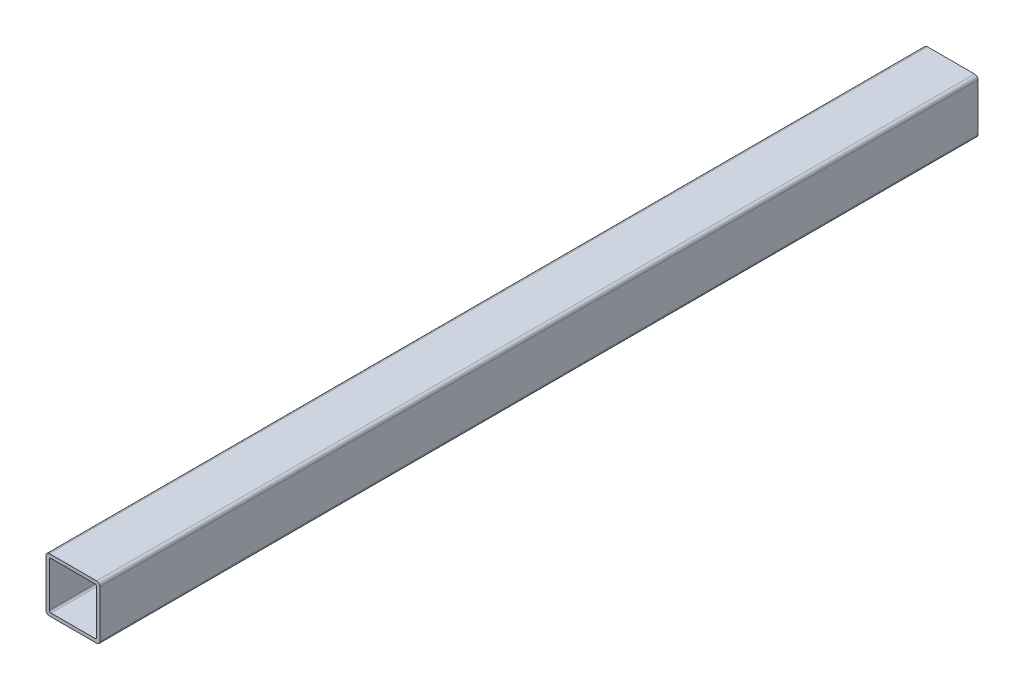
ISO-10303-21;
HEADER;
FILE_DESCRIPTION(('STEP AP214'),'2;1');
FILE_NAME('part.step','',(''),(''),'','','');
FILE_SCHEMA(('AUTOMOTIVE_DESIGN { 1 0 10303 214 1 1 1 1 }'));
ENDSEC;
DATA;
#1=APPLICATION_CONTEXT('core data for automotive mechanical design processes');
#2=APPLICATION_PROTOCOL_DEFINITION('international standard','automotive_design',2000,#1);
#3=PRODUCT_CONTEXT('',#1,'mechanical');
#4=PRODUCT('Part','Part','',(#3));
#5=PRODUCT_RELATED_PRODUCT_CATEGORY('part','',(#4));
#6=PRODUCT_DEFINITION_FORMATION('','',#4);
#7=PRODUCT_DEFINITION_CONTEXT('part definition',#1,'design');
#8=PRODUCT_DEFINITION('design','',#6,#7);
#9=PRODUCT_DEFINITION_SHAPE('','',#8);
#10=(LENGTH_UNIT() NAMED_UNIT(*) SI_UNIT(.MILLI.,.METRE.));
#11=(NAMED_UNIT(*) PLANE_ANGLE_UNIT() SI_UNIT($,.RADIAN.));
#12=(NAMED_UNIT(*) SI_UNIT($,.STERADIAN.) SOLID_ANGLE_UNIT());
#13=UNCERTAINTY_MEASURE_WITH_UNIT(LENGTH_MEASURE(1.E-05),#10,'distance_accuracy_value','');
#14=(GEOMETRIC_REPRESENTATION_CONTEXT(3) GLOBAL_UNCERTAINTY_ASSIGNED_CONTEXT((#13)) GLOBAL_UNIT_ASSIGNED_CONTEXT((#10,
#11,#12)) REPRESENTATION_CONTEXT('',''));
#15=CARTESIAN_POINT('',(0.,0.,0.));
#16=DIRECTION('',(0.,0.,1.));
#17=DIRECTION('',(1.,0.,0.));
#18=AXIS2_PLACEMENT_3D('',#15,#16,#17);
#19=CARTESIAN_POINT('',(-22.225,-22.225,412.75));
#20=DIRECTION('',(0.,0.,1.));
#21=DIRECTION('',(1.,0.,0.));
#22=AXIS2_PLACEMENT_3D('',#19,#20,#21);
#23=PLANE('',#22);
#24=CARTESIAN_POINT('',(-22.225,-22.225,412.75));
#25=DIRECTION('',(0.,0.,1.));
#26=DIRECTION('',(1.,0.,0.));
#27=AXIS2_PLACEMENT_3D('',#24,#25,#26);
#28=CIRCLE('',#27,3.175);
#29=CARTESIAN_POINT('',(-25.4,-22.225,412.75));
#30=VERTEX_POINT('',#29);
#31=CARTESIAN_POINT('',(-22.225,-25.4,412.75));
#32=VERTEX_POINT('',#31);
#33=EDGE_CURVE('E211',#30,#32,#28,.T.);
#34=ORIENTED_EDGE('',*,*,#33,.T.);
#35=DIRECTION('',(1.,0.,0.));
#36=VECTOR('',#35,1.);
#37=CARTESIAN_POINT('',(-22.225,-25.4,412.75));
#38=LINE('',#37,#36);
#39=CARTESIAN_POINT('',(22.225,-25.4,412.75));
#40=VERTEX_POINT('',#39);
#41=EDGE_CURVE('E214',#32,#40,#38,.T.);
#42=ORIENTED_EDGE('',*,*,#41,.T.);
#43=CARTESIAN_POINT('',(22.225,-22.225,412.75));
#44=DIRECTION('',(0.,0.,1.));
#45=DIRECTION('',(1.,0.,0.));
#46=AXIS2_PLACEMENT_3D('',#43,#44,#45);
#47=CIRCLE('',#46,3.175);
#48=CARTESIAN_POINT('',(25.4,-22.225,412.75));
#49=VERTEX_POINT('',#48);
#50=EDGE_CURVE('E217',#40,#49,#47,.T.);
#51=ORIENTED_EDGE('',*,*,#50,.T.);
#52=DIRECTION('',(0.,1.,0.));
#53=VECTOR('',#52,1.);
#54=CARTESIAN_POINT('',(25.4,22.225,412.75));
#55=LINE('',#54,#53);
#56=CARTESIAN_POINT('',(25.4,22.225,412.75));
#57=VERTEX_POINT('',#56);
#58=EDGE_CURVE('E219',#49,#57,#55,.T.);
#59=ORIENTED_EDGE('',*,*,#58,.T.);
#60=CARTESIAN_POINT('',(22.225,22.225,412.75));
#61=DIRECTION('',(0.,0.,1.));
#62=DIRECTION('',(-1.,0.,0.));
#63=AXIS2_PLACEMENT_3D('',#60,#61,#62);
#64=CIRCLE('',#63,3.175);
#65=CARTESIAN_POINT('',(22.225,25.4,412.75));
#66=VERTEX_POINT('',#65);
#67=EDGE_CURVE('E221',#57,#66,#64,.T.);
#68=ORIENTED_EDGE('',*,*,#67,.T.);
#69=DIRECTION('',(-1.,0.,0.));
#70=VECTOR('',#69,1.);
#71=CARTESIAN_POINT('',(-22.225,25.4,412.75));
#72=LINE('',#71,#70);
#73=CARTESIAN_POINT('',(-22.225,25.4,412.75));
#74=VERTEX_POINT('',#73);
#75=EDGE_CURVE('E223',#66,#74,#72,.T.);
#76=ORIENTED_EDGE('',*,*,#75,.T.);
#77=CARTESIAN_POINT('',(-22.225,22.225,412.75));
#78=DIRECTION('',(0.,0.,1.));
#79=DIRECTION('',(1.,0.,0.));
#80=AXIS2_PLACEMENT_3D('',#77,#78,#79);
#81=CIRCLE('',#80,3.175);
#82=CARTESIAN_POINT('',(-25.4,22.225,412.75));
#83=VERTEX_POINT('',#82);
#84=EDGE_CURVE('E225',#74,#83,#81,.T.);
#85=ORIENTED_EDGE('',*,*,#84,.T.);
#86=DIRECTION('',(0.,-1.,0.));
#87=VECTOR('',#86,1.);
#88=CARTESIAN_POINT('',(-25.4,22.225,412.75));
#89=LINE('',#88,#87);
#90=EDGE_CURVE('E227',#83,#30,#89,.T.);
#91=ORIENTED_EDGE('',*,*,#90,.T.);
#92=EDGE_LOOP('',(#34,#42,#51,#59,#68,#76,#85,#91));
#93=FACE_BOUND('',#92,.T.);
#94=DIRECTION('',(0.,-1.,0.));
#95=VECTOR('',#94,1.);
#96=CARTESIAN_POINT('',(-22.225,20.6375,412.75));
#97=LINE('',#96,#95);
#98=CARTESIAN_POINT('',(-22.225,20.6375,412.75));
#99=VERTEX_POINT('',#98);
#100=CARTESIAN_POINT('',(-22.225,-20.6375,412.75));
#101=VERTEX_POINT('',#100);
#102=EDGE_CURVE('E154',#99,#101,#97,.T.);
#103=ORIENTED_EDGE('',*,*,#102,.F.);
#104=CARTESIAN_POINT('',(-20.6375,20.6375,412.75));
#105=DIRECTION('',(0.,0.,1.));
#106=DIRECTION('',(1.,0.,0.));
#107=AXIS2_PLACEMENT_3D('',#104,#105,#106);
#108=CIRCLE('',#107,1.5875);
#109=CARTESIAN_POINT('',(-20.6375,22.225,412.75));
#110=VERTEX_POINT('',#109);
#111=EDGE_CURVE('E146',#110,#99,#108,.T.);
#112=ORIENTED_EDGE('',*,*,#111,.F.);
#113=DIRECTION('',(-1.,0.,0.));
#114=VECTOR('',#113,1.);
#115=CARTESIAN_POINT('',(-20.6375,22.225,412.75));
#116=LINE('',#115,#114);
#117=CARTESIAN_POINT('',(20.6375,22.225,412.75));
#118=VERTEX_POINT('',#117);
#119=EDGE_CURVE('E179',#118,#110,#116,.T.);
#120=ORIENTED_EDGE('',*,*,#119,.F.);
#121=CARTESIAN_POINT('',(20.6375,20.6375,412.75));
#122=DIRECTION('',(0.,0.,1.));
#123=DIRECTION('',(-1.,0.,0.));
#124=AXIS2_PLACEMENT_3D('',#121,#122,#123);
#125=CIRCLE('',#124,1.5875);
#126=CARTESIAN_POINT('',(22.225,20.6375,412.75));
#127=VERTEX_POINT('',#126);
#128=EDGE_CURVE('E177',#127,#118,#125,.T.);
#129=ORIENTED_EDGE('',*,*,#128,.F.);
#130=DIRECTION('',(0.,1.,0.));
#131=VECTOR('',#130,1.);
#132=CARTESIAN_POINT('',(22.225,20.6375,412.75));
#133=LINE('',#132,#131);
#134=CARTESIAN_POINT('',(22.225,-20.6375,412.75));
#135=VERTEX_POINT('',#134);
#136=EDGE_CURVE('E175',#135,#127,#133,.T.);
#137=ORIENTED_EDGE('',*,*,#136,.F.);
#138=CARTESIAN_POINT('',(20.6375,-20.6375,412.75));
#139=DIRECTION('',(0.,0.,1.));
#140=DIRECTION('',(1.,0.,0.));
#141=AXIS2_PLACEMENT_3D('',#138,#139,#140);
#142=CIRCLE('',#141,1.5875);
#143=CARTESIAN_POINT('',(20.6375,-22.225,412.75));
#144=VERTEX_POINT('',#143);
#145=EDGE_CURVE('E173',#144,#135,#142,.T.);
#146=ORIENTED_EDGE('',*,*,#145,.F.);
#147=DIRECTION('',(1.,0.,0.));
#148=VECTOR('',#147,1.);
#149=CARTESIAN_POINT('',(-20.6375,-22.225,412.75));
#150=LINE('',#149,#148);
#151=CARTESIAN_POINT('',(-20.6375,-22.225,412.75));
#152=VERTEX_POINT('',#151);
#153=EDGE_CURVE('E169',#152,#144,#150,.T.);
#154=ORIENTED_EDGE('',*,*,#153,.F.);
#155=CARTESIAN_POINT('',(-20.6375,-20.6375,412.75));
#156=DIRECTION('',(0.,0.,1.));
#157=DIRECTION('',(1.,0.,0.));
#158=AXIS2_PLACEMENT_3D('',#155,#156,#157);
#159=CIRCLE('',#158,1.5875);
#160=EDGE_CURVE('E167',#101,#152,#159,.T.);
#161=ORIENTED_EDGE('',*,*,#160,.F.);
#162=EDGE_LOOP('',(#103,#112,#120,#129,#137,#146,#154,#161));
#163=FACE_BOUND('',#162,.T.);
#164=ADVANCED_FACE('F33',(#93,#163),#23,.T.);
#165=CARTESIAN_POINT('',(-22.225,-22.225,-412.75));
#166=DIRECTION('',(0.,0.,1.));
#167=DIRECTION('',(1.,0.,0.));
#168=AXIS2_PLACEMENT_3D('',#165,#166,#167);
#169=PLANE('',#168);
#170=CARTESIAN_POINT('',(-22.225,-22.225,-412.75));
#171=DIRECTION('',(0.,0.,1.));
#172=DIRECTION('',(1.,0.,0.));
#173=AXIS2_PLACEMENT_3D('',#170,#171,#172);
#174=CIRCLE('',#173,3.175);
#175=CARTESIAN_POINT('',(-25.4,-22.225,-412.75));
#176=VERTEX_POINT('',#175);
#177=CARTESIAN_POINT('',(-22.225,-25.4,-412.75));
#178=VERTEX_POINT('',#177);
#179=EDGE_CURVE('E162',#176,#178,#174,.T.);
#180=ORIENTED_EDGE('',*,*,#179,.F.);
#181=DIRECTION('',(0.,-1.,0.));
#182=VECTOR('',#181,1.);
#183=CARTESIAN_POINT('',(-25.4,22.225,-412.75));
#184=LINE('',#183,#182);
#185=CARTESIAN_POINT('',(-25.4,22.225,-412.75));
#186=VERTEX_POINT('',#185);
#187=EDGE_CURVE('E215',#186,#176,#184,.T.);
#188=ORIENTED_EDGE('',*,*,#187,.F.);
#189=CARTESIAN_POINT('',(-22.225,22.225,-412.75));
#190=DIRECTION('',(0.,0.,1.));
#191=DIRECTION('',(1.,0.,0.));
#192=AXIS2_PLACEMENT_3D('',#189,#190,#191);
#193=CIRCLE('',#192,3.175);
#194=CARTESIAN_POINT('',(-22.225,25.4,-412.75));
#195=VERTEX_POINT('',#194);
#196=EDGE_CURVE('E242',#195,#186,#193,.T.);
#197=ORIENTED_EDGE('',*,*,#196,.F.);
#198=DIRECTION('',(-1.,0.,0.));
#199=VECTOR('',#198,1.);
#200=CARTESIAN_POINT('',(-22.225,25.4,-412.75));
#201=LINE('',#200,#199);
#202=CARTESIAN_POINT('',(22.225,25.4,-412.75));
#203=VERTEX_POINT('',#202);
#204=EDGE_CURVE('E240',#203,#195,#201,.T.);
#205=ORIENTED_EDGE('',*,*,#204,.F.);
#206=CARTESIAN_POINT('',(22.225,22.225,-412.75));
#207=DIRECTION('',(0.,0.,1.));
#208=DIRECTION('',(-1.,0.,0.));
#209=AXIS2_PLACEMENT_3D('',#206,#207,#208);
#210=CIRCLE('',#209,3.175);
#211=CARTESIAN_POINT('',(25.4,22.225,-412.75));
#212=VERTEX_POINT('',#211);
#213=EDGE_CURVE('E238',#212,#203,#210,.T.);
#214=ORIENTED_EDGE('',*,*,#213,.F.);
#215=DIRECTION('',(0.,1.,0.));
#216=VECTOR('',#215,1.);
#217=CARTESIAN_POINT('',(25.4,22.225,-412.75));
#218=LINE('',#217,#216);
#219=CARTESIAN_POINT('',(25.4,-22.225,-412.75));
#220=VERTEX_POINT('',#219);
#221=EDGE_CURVE('E236',#220,#212,#218,.T.);
#222=ORIENTED_EDGE('',*,*,#221,.F.);
#223=CARTESIAN_POINT('',(22.225,-22.225,-412.75));
#224=DIRECTION('',(0.,0.,1.));
#225=DIRECTION('',(1.,0.,0.));
#226=AXIS2_PLACEMENT_3D('',#223,#224,#225);
#227=CIRCLE('',#226,3.175);
#228=CARTESIAN_POINT('',(22.225,-25.4,-412.75));
#229=VERTEX_POINT('',#228);
#230=EDGE_CURVE('E234',#229,#220,#227,.T.);
#231=ORIENTED_EDGE('',*,*,#230,.F.);
#232=DIRECTION('',(1.,0.,0.));
#233=VECTOR('',#232,1.);
#234=CARTESIAN_POINT('',(-22.225,-25.4,-412.75));
#235=LINE('',#234,#233);
#236=EDGE_CURVE('E232',#178,#229,#235,.T.);
#237=ORIENTED_EDGE('',*,*,#236,.F.);
#238=EDGE_LOOP('',(#180,#188,#197,#205,#214,#222,#231,#237));
#239=FACE_BOUND('',#238,.T.);
#240=CARTESIAN_POINT('',(-20.6375,20.6375,-412.75));
#241=DIRECTION('',(0.,0.,1.));
#242=DIRECTION('',(1.,0.,0.));
#243=AXIS2_PLACEMENT_3D('',#240,#241,#242);
#244=CIRCLE('',#243,1.5875);
#245=CARTESIAN_POINT('',(-20.6375,22.225,-412.75));
#246=VERTEX_POINT('',#245);
#247=CARTESIAN_POINT('',(-22.225,20.6375,-412.75));
#248=VERTEX_POINT('',#247);
#249=EDGE_CURVE('E56',#246,#248,#244,.T.);
#250=ORIENTED_EDGE('',*,*,#249,.T.);
#251=DIRECTION('',(0.,-1.,0.));
#252=VECTOR('',#251,1.);
#253=CARTESIAN_POINT('',(-22.225,20.6375,-412.75));
#254=LINE('',#253,#252);
#255=CARTESIAN_POINT('',(-22.225,-20.6375,-412.75));
#256=VERTEX_POINT('',#255);
#257=EDGE_CURVE('E161',#248,#256,#254,.T.);
#258=ORIENTED_EDGE('',*,*,#257,.T.);
#259=CARTESIAN_POINT('',(-20.6375,-20.6375,-412.75));
#260=DIRECTION('',(0.,0.,1.));
#261=DIRECTION('',(1.,0.,0.));
#262=AXIS2_PLACEMENT_3D('',#259,#260,#261);
#263=CIRCLE('',#262,1.5875);
#264=CARTESIAN_POINT('',(-20.6375,-22.225,-412.75));
#265=VERTEX_POINT('',#264);
#266=EDGE_CURVE('E183',#256,#265,#263,.T.);
#267=ORIENTED_EDGE('',*,*,#266,.T.);
#268=DIRECTION('',(1.,0.,0.));
#269=VECTOR('',#268,1.);
#270=CARTESIAN_POINT('',(-20.6375,-22.225,-412.75));
#271=LINE('',#270,#269);
#272=CARTESIAN_POINT('',(20.6375,-22.225,-412.75));
#273=VERTEX_POINT('',#272);
#274=EDGE_CURVE('E186',#265,#273,#271,.T.);
#275=ORIENTED_EDGE('',*,*,#274,.T.);
#276=CARTESIAN_POINT('',(20.6375,-20.6375,-412.75));
#277=DIRECTION('',(0.,0.,1.));
#278=DIRECTION('',(1.,0.,0.));
#279=AXIS2_PLACEMENT_3D('',#276,#277,#278);
#280=CIRCLE('',#279,1.5875);
#281=CARTESIAN_POINT('',(22.225,-20.6375,-412.75));
#282=VERTEX_POINT('',#281);
#283=EDGE_CURVE('E189',#273,#282,#280,.T.);
#284=ORIENTED_EDGE('',*,*,#283,.T.);
#285=DIRECTION('',(0.,1.,0.));
#286=VECTOR('',#285,1.);
#287=CARTESIAN_POINT('',(22.225,20.6375,-412.75));
#288=LINE('',#287,#286);
#289=CARTESIAN_POINT('',(22.225,20.6375,-412.75));
#290=VERTEX_POINT('',#289);
#291=EDGE_CURVE('E192',#282,#290,#288,.T.);
#292=ORIENTED_EDGE('',*,*,#291,.T.);
#293=CARTESIAN_POINT('',(20.6375,20.6375,-412.75));
#294=DIRECTION('',(0.,0.,1.));
#295=DIRECTION('',(-1.,0.,0.));
#296=AXIS2_PLACEMENT_3D('',#293,#294,#295);
#297=CIRCLE('',#296,1.5875);
#298=CARTESIAN_POINT('',(20.6375,22.225,-412.75));
#299=VERTEX_POINT('',#298);
#300=EDGE_CURVE('E195',#290,#299,#297,.T.);
#301=ORIENTED_EDGE('',*,*,#300,.T.);
#302=DIRECTION('',(-1.,0.,0.));
#303=VECTOR('',#302,1.);
#304=CARTESIAN_POINT('',(-20.6375,22.225,-412.75));
#305=LINE('',#304,#303);
#306=EDGE_CURVE('E155',#299,#246,#305,.T.);
#307=ORIENTED_EDGE('',*,*,#306,.T.);
#308=EDGE_LOOP('',(#250,#258,#267,#275,#284,#292,#301,#307));
#309=FACE_BOUND('',#308,.T.);
#310=ADVANCED_FACE('F272',(#239,#309),#169,.F.);
#311=CARTESIAN_POINT('',(-22.225,-22.225,412.75));
#312=DIRECTION('',(0.,0.,-1.));
#313=DIRECTION('',(-1.,0.,0.));
#314=AXIS2_PLACEMENT_3D('',#311,#312,#313);
#315=CYLINDRICAL_SURFACE('',#314,3.175);
#316=ORIENTED_EDGE('',*,*,#179,.T.);
#317=DIRECTION('',(0.,0.,-1.));
#318=VECTOR('',#317,1.);
#319=CARTESIAN_POINT('',(-22.225,-25.4,412.75));
#320=LINE('',#319,#318);
#321=EDGE_CURVE('E11',#32,#178,#320,.T.);
#322=ORIENTED_EDGE('',*,*,#321,.F.);
#323=ORIENTED_EDGE('',*,*,#33,.F.);
#324=DIRECTION('',(0.,0.,-1.));
#325=VECTOR('',#324,1.);
#326=CARTESIAN_POINT('',(-25.4,-22.225,412.75));
#327=LINE('',#326,#325);
#328=EDGE_CURVE('E229',#30,#176,#327,.T.);
#329=ORIENTED_EDGE('',*,*,#328,.T.);
#330=EDGE_LOOP('',(#316,#322,#323,#329));
#331=FACE_BOUND('',#330,.T.);
#332=ADVANCED_FACE('F35',(#331),#315,.T.);
#333=CARTESIAN_POINT('',(-22.225,-25.4,412.75));
#334=DIRECTION('',(0.,1.,0.));
#335=DIRECTION('',(0.,0.,1.));
#336=AXIS2_PLACEMENT_3D('',#333,#334,#335);
#337=PLANE('',#336);
#338=ORIENTED_EDGE('',*,*,#236,.T.);
#339=DIRECTION('',(0.,0.,-1.));
#340=VECTOR('',#339,1.);
#341=CARTESIAN_POINT('',(22.225,-25.4,412.75));
#342=LINE('',#341,#340);
#343=EDGE_CURVE('E41',#40,#229,#342,.T.);
#344=ORIENTED_EDGE('',*,*,#343,.F.);
#345=ORIENTED_EDGE('',*,*,#41,.F.);
#346=ORIENTED_EDGE('',*,*,#321,.T.);
#347=EDGE_LOOP('',(#338,#344,#345,#346));
#348=FACE_BOUND('',#347,.T.);
#349=ADVANCED_FACE('F289',(#348),#337,.F.);
#350=CARTESIAN_POINT('',(22.225,-22.225,412.75));
#351=DIRECTION('',(0.,0.,-1.));
#352=DIRECTION('',(-1.,0.,0.));
#353=AXIS2_PLACEMENT_3D('',#350,#351,#352);
#354=CYLINDRICAL_SURFACE('',#353,3.175);
#355=ORIENTED_EDGE('',*,*,#230,.T.);
#356=DIRECTION('',(0.,0.,-1.));
#357=VECTOR('',#356,1.);
#358=CARTESIAN_POINT('',(25.4,-22.225,412.75));
#359=LINE('',#358,#357);
#360=EDGE_CURVE('E259',#49,#220,#359,.T.);
#361=ORIENTED_EDGE('',*,*,#360,.F.);
#362=ORIENTED_EDGE('',*,*,#50,.F.);
#363=ORIENTED_EDGE('',*,*,#343,.T.);
#364=EDGE_LOOP('',(#355,#361,#362,#363));
#365=FACE_BOUND('',#364,.T.);
#366=ADVANCED_FACE('F266',(#365),#354,.T.);
#367=CARTESIAN_POINT('',(25.4,22.225,412.75));
#368=DIRECTION('',(-1.,0.,0.));
#369=DIRECTION('',(0.,-1.,0.));
#370=AXIS2_PLACEMENT_3D('',#367,#368,#369);
#371=PLANE('',#370);
#372=ORIENTED_EDGE('',*,*,#221,.T.);
#373=DIRECTION('',(0.,0.,-1.));
#374=VECTOR('',#373,1.);
#375=CARTESIAN_POINT('',(25.4,22.225,412.75));
#376=LINE('',#375,#374);
#377=EDGE_CURVE('E256',#57,#212,#376,.T.);
#378=ORIENTED_EDGE('',*,*,#377,.F.);
#379=ORIENTED_EDGE('',*,*,#58,.F.);
#380=ORIENTED_EDGE('',*,*,#360,.T.);
#381=EDGE_LOOP('',(#372,#378,#379,#380));
#382=FACE_BOUND('',#381,.T.);
#383=ADVANCED_FACE('F278',(#382),#371,.F.);
#384=CARTESIAN_POINT('',(22.225,22.225,412.75));
#385=DIRECTION('',(0.,0.,-1.));
#386=DIRECTION('',(-1.,0.,0.));
#387=AXIS2_PLACEMENT_3D('',#384,#385,#386);
#388=CYLINDRICAL_SURFACE('',#387,3.175);
#389=ORIENTED_EDGE('',*,*,#213,.T.);
#390=DIRECTION('',(0.,0.,-1.));
#391=VECTOR('',#390,1.);
#392=CARTESIAN_POINT('',(22.225,25.4,412.75));
#393=LINE('',#392,#391);
#394=EDGE_CURVE('E253',#66,#203,#393,.T.);
#395=ORIENTED_EDGE('',*,*,#394,.F.);
#396=ORIENTED_EDGE('',*,*,#67,.F.);
#397=ORIENTED_EDGE('',*,*,#377,.T.);
#398=EDGE_LOOP('',(#389,#395,#396,#397));
#399=FACE_BOUND('',#398,.T.);
#400=ADVANCED_FACE('F282',(#399),#388,.T.);
#401=CARTESIAN_POINT('',(-22.225,25.4,412.75));
#402=DIRECTION('',(0.,-1.,0.));
#403=DIRECTION('',(0.,0.,-1.));
#404=AXIS2_PLACEMENT_3D('',#401,#402,#403);
#405=PLANE('',#404);
#406=ORIENTED_EDGE('',*,*,#204,.T.);
#407=DIRECTION('',(0.,0.,-1.));
#408=VECTOR('',#407,1.);
#409=CARTESIAN_POINT('',(-22.225,25.4,412.75));
#410=LINE('',#409,#408);
#411=EDGE_CURVE('E250',#74,#195,#410,.T.);
#412=ORIENTED_EDGE('',*,*,#411,.F.);
#413=ORIENTED_EDGE('',*,*,#75,.F.);
#414=ORIENTED_EDGE('',*,*,#394,.T.);
#415=EDGE_LOOP('',(#406,#412,#413,#414));
#416=FACE_BOUND('',#415,.T.);
#417=ADVANCED_FACE('F302',(#416),#405,.F.);
#418=CARTESIAN_POINT('',(-22.225,22.225,412.75));
#419=DIRECTION('',(0.,0.,-1.));
#420=DIRECTION('',(-1.,0.,0.));
#421=AXIS2_PLACEMENT_3D('',#418,#419,#420);
#422=CYLINDRICAL_SURFACE('',#421,3.175);
#423=ORIENTED_EDGE('',*,*,#196,.T.);
#424=DIRECTION('',(0.,0.,-1.));
#425=VECTOR('',#424,1.);
#426=CARTESIAN_POINT('',(-25.4,22.225,412.75));
#427=LINE('',#426,#425);
#428=EDGE_CURVE('E247',#83,#186,#427,.T.);
#429=ORIENTED_EDGE('',*,*,#428,.F.);
#430=ORIENTED_EDGE('',*,*,#84,.F.);
#431=ORIENTED_EDGE('',*,*,#411,.T.);
#432=EDGE_LOOP('',(#423,#429,#430,#431));
#433=FACE_BOUND('',#432,.T.);
#434=ADVANCED_FACE('F300',(#433),#422,.T.);
#435=CARTESIAN_POINT('',(-25.4,22.225,412.75));
#436=DIRECTION('',(1.,0.,0.));
#437=DIRECTION('',(0.,1.,0.));
#438=AXIS2_PLACEMENT_3D('',#435,#436,#437);
#439=PLANE('',#438);
#440=ORIENTED_EDGE('',*,*,#187,.T.);
#441=ORIENTED_EDGE('',*,*,#328,.F.);
#442=ORIENTED_EDGE('',*,*,#90,.F.);
#443=ORIENTED_EDGE('',*,*,#428,.T.);
#444=EDGE_LOOP('',(#440,#441,#442,#443));
#445=FACE_BOUND('',#444,.T.);
#446=ADVANCED_FACE('F295',(#445),#439,.F.);
#447=CARTESIAN_POINT('',(-20.6375,20.6375,412.75));
#448=DIRECTION('',(0.,0.,-1.));
#449=DIRECTION('',(-1.,0.,0.));
#450=AXIS2_PLACEMENT_3D('',#447,#448,#449);
#451=CYLINDRICAL_SURFACE('',#450,1.5875);
#452=ORIENTED_EDGE('',*,*,#249,.F.);
#453=DIRECTION('',(0.,0.,-1.));
#454=VECTOR('',#453,1.);
#455=CARTESIAN_POINT('',(-20.6375,22.225,412.75));
#456=LINE('',#455,#454);
#457=EDGE_CURVE('E150',#110,#246,#456,.T.);
#458=ORIENTED_EDGE('',*,*,#457,.F.);
#459=ORIENTED_EDGE('',*,*,#111,.T.);
#460=DIRECTION('',(0.,0.,-1.));
#461=VECTOR('',#460,1.);
#462=CARTESIAN_POINT('',(-22.225,20.6375,412.75));
#463=LINE('',#462,#461);
#464=EDGE_CURVE('E149',#99,#248,#463,.T.);
#465=ORIENTED_EDGE('',*,*,#464,.T.);
#466=EDGE_LOOP('',(#452,#458,#459,#465));
#467=FACE_BOUND('',#466,.T.);
#468=ADVANCED_FACE('F148',(#467),#451,.F.);
#469=CARTESIAN_POINT('',(-22.225,20.6375,412.75));
#470=DIRECTION('',(1.,0.,0.));
#471=DIRECTION('',(0.,0.,-1.));
#472=AXIS2_PLACEMENT_3D('',#469,#470,#471);
#473=PLANE('',#472);
#474=ORIENTED_EDGE('',*,*,#257,.F.);
#475=ORIENTED_EDGE('',*,*,#464,.F.);
#476=ORIENTED_EDGE('',*,*,#102,.T.);
#477=DIRECTION('',(0.,0.,-1.));
#478=VECTOR('',#477,1.);
#479=CARTESIAN_POINT('',(-22.225,-20.6375,412.75));
#480=LINE('',#479,#478);
#481=EDGE_CURVE('E163',#101,#256,#480,.T.);
#482=ORIENTED_EDGE('',*,*,#481,.T.);
#483=EDGE_LOOP('',(#474,#475,#476,#482));
#484=FACE_BOUND('',#483,.T.);
#485=ADVANCED_FACE('F158',(#484),#473,.T.);
#486=CARTESIAN_POINT('',(-20.6375,-20.6375,412.75));
#487=DIRECTION('',(0.,0.,-1.));
#488=DIRECTION('',(-1.,0.,0.));
#489=AXIS2_PLACEMENT_3D('',#486,#487,#488);
#490=CYLINDRICAL_SURFACE('',#489,1.5875);
#491=ORIENTED_EDGE('',*,*,#266,.F.);
#492=ORIENTED_EDGE('',*,*,#481,.F.);
#493=ORIENTED_EDGE('',*,*,#160,.T.);
#494=DIRECTION('',(0.,0.,-1.));
#495=VECTOR('',#494,1.);
#496=CARTESIAN_POINT('',(-20.6375,-22.225,412.75));
#497=LINE('',#496,#495);
#498=EDGE_CURVE('E208',#152,#265,#497,.T.);
#499=ORIENTED_EDGE('',*,*,#498,.T.);
#500=EDGE_LOOP('',(#491,#492,#493,#499));
#501=FACE_BOUND('',#500,.T.);
#502=ADVANCED_FACE('F327',(#501),#490,.F.);
#503=CARTESIAN_POINT('',(-20.6375,-22.225,412.75));
#504=DIRECTION('',(0.,1.,0.));
#505=DIRECTION('',(0.,0.,1.));
#506=AXIS2_PLACEMENT_3D('',#503,#504,#505);
#507=PLANE('',#506);
#508=ORIENTED_EDGE('',*,*,#274,.F.);
#509=ORIENTED_EDGE('',*,*,#498,.F.);
#510=ORIENTED_EDGE('',*,*,#153,.T.);
#511=DIRECTION('',(0.,0.,-1.));
#512=VECTOR('',#511,1.);
#513=CARTESIAN_POINT('',(20.6375,-22.225,412.75));
#514=LINE('',#513,#512);
#515=EDGE_CURVE('E206',#144,#273,#514,.T.);
#516=ORIENTED_EDGE('',*,*,#515,.T.);
#517=EDGE_LOOP('',(#508,#509,#510,#516));
#518=FACE_BOUND('',#517,.T.);
#519=ADVANCED_FACE('F331',(#518),#507,.T.);
#520=CARTESIAN_POINT('',(20.6375,-20.6375,412.75));
#521=DIRECTION('',(0.,0.,-1.));
#522=DIRECTION('',(-1.,0.,0.));
#523=AXIS2_PLACEMENT_3D('',#520,#521,#522);
#524=CYLINDRICAL_SURFACE('',#523,1.5875);
#525=ORIENTED_EDGE('',*,*,#283,.F.);
#526=ORIENTED_EDGE('',*,*,#515,.F.);
#527=ORIENTED_EDGE('',*,*,#145,.T.);
#528=DIRECTION('',(0.,0.,-1.));
#529=VECTOR('',#528,1.);
#530=CARTESIAN_POINT('',(22.225,-20.6375,412.75));
#531=LINE('',#530,#529);
#532=EDGE_CURVE('E204',#135,#282,#531,.T.);
#533=ORIENTED_EDGE('',*,*,#532,.T.);
#534=EDGE_LOOP('',(#525,#526,#527,#533));
#535=FACE_BOUND('',#534,.T.);
#536=ADVANCED_FACE('F337',(#535),#524,.F.);
#537=CARTESIAN_POINT('',(22.225,20.6375,412.75));
#538=DIRECTION('',(-1.,0.,0.));
#539=DIRECTION('',(0.,-1.,0.));
#540=AXIS2_PLACEMENT_3D('',#537,#538,#539);
#541=PLANE('',#540);
#542=ORIENTED_EDGE('',*,*,#291,.F.);
#543=ORIENTED_EDGE('',*,*,#532,.F.);
#544=ORIENTED_EDGE('',*,*,#136,.T.);
#545=DIRECTION('',(0.,0.,-1.));
#546=VECTOR('',#545,1.);
#547=CARTESIAN_POINT('',(22.225,20.6375,412.75));
#548=LINE('',#547,#546);
#549=EDGE_CURVE('E202',#127,#290,#548,.T.);
#550=ORIENTED_EDGE('',*,*,#549,.T.);
#551=EDGE_LOOP('',(#542,#543,#544,#550));
#552=FACE_BOUND('',#551,.T.);
#553=ADVANCED_FACE('F341',(#552),#541,.T.);
#554=CARTESIAN_POINT('',(20.6375,20.6375,412.75));
#555=DIRECTION('',(0.,0.,-1.));
#556=DIRECTION('',(-1.,0.,0.));
#557=AXIS2_PLACEMENT_3D('',#554,#555,#556);
#558=CYLINDRICAL_SURFACE('',#557,1.5875);
#559=ORIENTED_EDGE('',*,*,#300,.F.);
#560=ORIENTED_EDGE('',*,*,#549,.F.);
#561=ORIENTED_EDGE('',*,*,#128,.T.);
#562=DIRECTION('',(0.,0.,-1.));
#563=VECTOR('',#562,1.);
#564=CARTESIAN_POINT('',(20.6375,22.225,412.75));
#565=LINE('',#564,#563);
#566=EDGE_CURVE('E48',#118,#299,#565,.T.);
#567=ORIENTED_EDGE('',*,*,#566,.T.);
#568=EDGE_LOOP('',(#559,#560,#561,#567));
#569=FACE_BOUND('',#568,.T.);
#570=ADVANCED_FACE('F345',(#569),#558,.F.);
#571=CARTESIAN_POINT('',(-20.6375,22.225,412.75));
#572=DIRECTION('',(0.,-1.,0.));
#573=DIRECTION('',(0.,0.,-1.));
#574=AXIS2_PLACEMENT_3D('',#571,#572,#573);
#575=PLANE('',#574);
#576=ORIENTED_EDGE('',*,*,#306,.F.);
#577=ORIENTED_EDGE('',*,*,#566,.F.);
#578=ORIENTED_EDGE('',*,*,#119,.T.);
#579=ORIENTED_EDGE('',*,*,#457,.T.);
#580=EDGE_LOOP('',(#576,#577,#578,#579));
#581=FACE_BOUND('',#580,.T.);
#582=ADVANCED_FACE('F349',(#581),#575,.T.);
#583=CLOSED_SHELL('',(#164,#310,#332,#349,#366,#383,#400,#417,#434,#446,#468,#485,#502,#519,
#536,#553,#570,#582));
#584=MANIFOLD_SOLID_BREP('B2',#583);
#585=ADVANCED_BREP_SHAPE_REPRESENTATION('',(#18,#584),#14);
#586=SHAPE_DEFINITION_REPRESENTATION(#9,#585);
ENDSEC;
END-ISO-10303-21;
